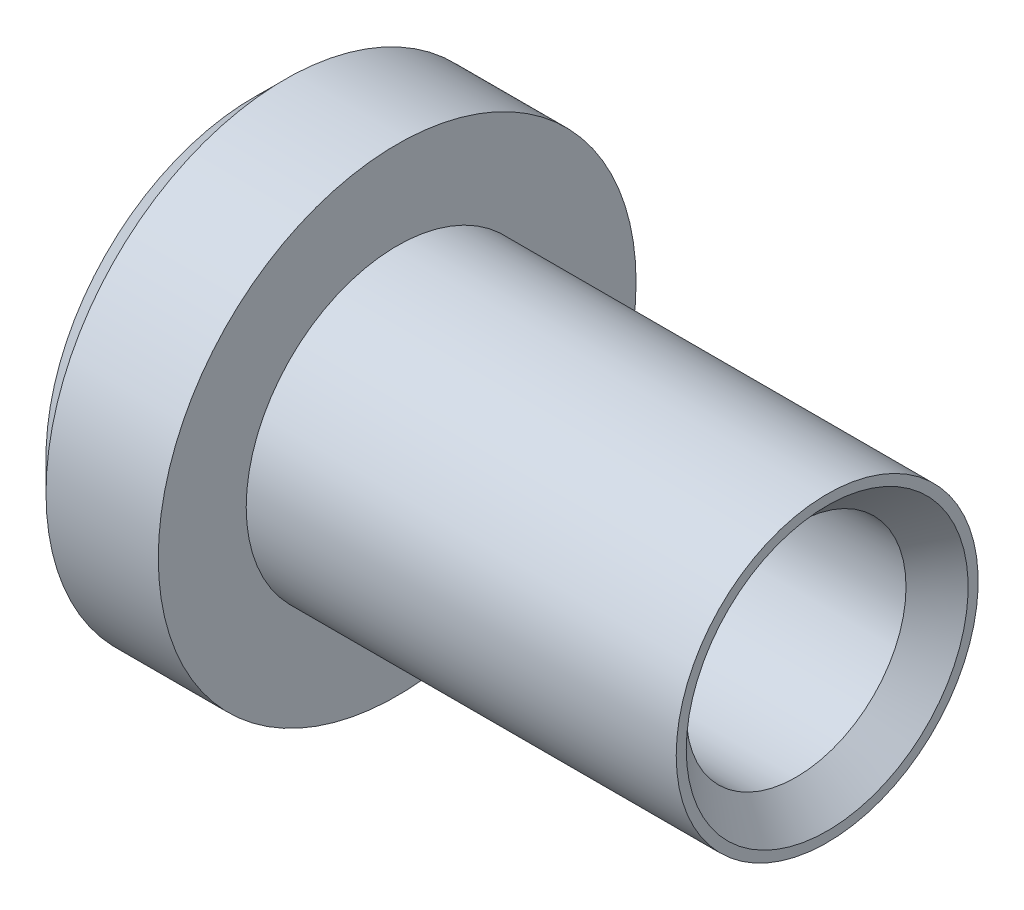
from build123d import *

# Parameters (mm, degrees)
CHAMFER1_SIZE = 0.8255


with BuildPart() as part:
    # Sketch1 → Revolve1 (revolve)
    with BuildSketch(Plane.XY, mode=Mode.PRIVATE) as revolve1_sk:
        Polygon((0, 0), (2.689886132, 0), (4.445, 2.921), (15.24, 2.921), (15.24, 4.0132), (3.81, 4.0132), (3.81, 6.35), (0, 6.35), align=None)
    revolve(revolve1_sk.sketch.rotate(Axis((0, 0, 0), (1, 0, 0)), 90), axis=Axis((0, 0, 0), (1, 0, 0)))

    # Chamfer1
    chamfer1_edges = [part.edges().sort_by_distance(p)[0] for p in [
        (15.24, 0, -2.921),
        (0, 0, -6.35),
    ]]
    chamfer(chamfer1_edges, length=CHAMFER1_SIZE)


solid = part.part
